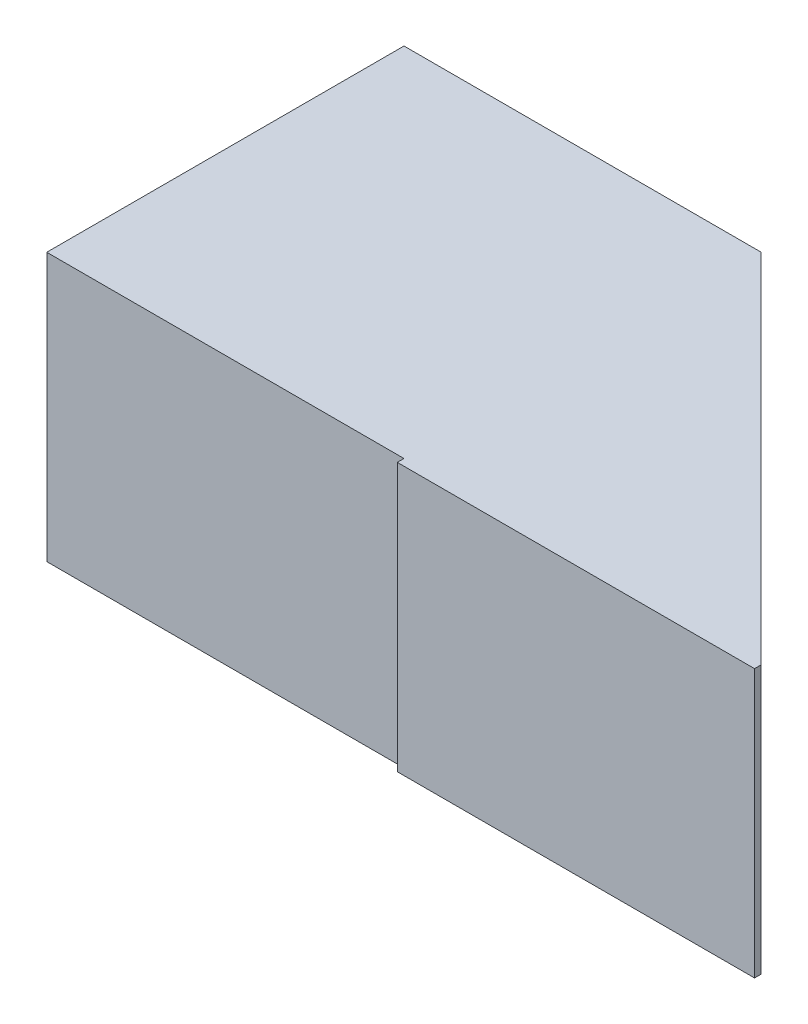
ISO-10303-21;
HEADER;
FILE_DESCRIPTION(('STEP AP214'),'2;1');
FILE_NAME('part.step','',(''),(''),'','','');
FILE_SCHEMA(('AUTOMOTIVE_DESIGN { 1 0 10303 214 1 1 1 1 }'));
ENDSEC;
DATA;
#1=APPLICATION_CONTEXT('core data for automotive mechanical design processes');
#2=APPLICATION_PROTOCOL_DEFINITION('international standard','automotive_design',2000,#1);
#3=PRODUCT_CONTEXT('',#1,'mechanical');
#4=PRODUCT('Part','Part','',(#3));
#5=PRODUCT_RELATED_PRODUCT_CATEGORY('part','',(#4));
#6=PRODUCT_DEFINITION_FORMATION('','',#4);
#7=PRODUCT_DEFINITION_CONTEXT('part definition',#1,'design');
#8=PRODUCT_DEFINITION('design','',#6,#7);
#9=PRODUCT_DEFINITION_SHAPE('','',#8);
#10=(LENGTH_UNIT() NAMED_UNIT(*) SI_UNIT(.MILLI.,.METRE.));
#11=(NAMED_UNIT(*) PLANE_ANGLE_UNIT() SI_UNIT($,.RADIAN.));
#12=(NAMED_UNIT(*) SI_UNIT($,.STERADIAN.) SOLID_ANGLE_UNIT());
#13=UNCERTAINTY_MEASURE_WITH_UNIT(LENGTH_MEASURE(1.E-05),#10,'distance_accuracy_value','');
#14=(GEOMETRIC_REPRESENTATION_CONTEXT(3) GLOBAL_UNCERTAINTY_ASSIGNED_CONTEXT((#13)) GLOBAL_UNIT_ASSIGNED_CONTEXT((#10,
#11,#12)) REPRESENTATION_CONTEXT('',''));
#15=CARTESIAN_POINT('',(0.,0.,0.));
#16=DIRECTION('',(0.,0.,1.));
#17=DIRECTION('',(1.,0.,0.));
#18=AXIS2_PLACEMENT_3D('',#15,#16,#17);
#19=CARTESIAN_POINT('',(0.,6.,0.));
#20=DIRECTION('',(0.,0.,-1.));
#21=DIRECTION('',(-1.,0.,0.));
#22=AXIS2_PLACEMENT_3D('',#19,#20,#21);
#23=PLANE('',#22);
#24=DIRECTION('',(0.,-1.,0.));
#25=VECTOR('',#24,1.);
#26=CARTESIAN_POINT('',(8.,6.,0.));
#27=LINE('',#26,#25);
#28=CARTESIAN_POINT('',(8.,6.,0.));
#29=VERTEX_POINT('',#28);
#30=CARTESIAN_POINT('',(8.,0.,0.));
#31=VERTEX_POINT('',#30);
#32=EDGE_CURVE('E49',#29,#31,#27,.T.);
#33=ORIENTED_EDGE('',*,*,#32,.F.);
#34=DIRECTION('',(1.,0.,0.));
#35=VECTOR('',#34,1.);
#36=CARTESIAN_POINT('',(0.,6.,0.));
#37=LINE('',#36,#35);
#38=CARTESIAN_POINT('',(0.,6.,0.));
#39=VERTEX_POINT('',#38);
#40=EDGE_CURVE('E82',#39,#29,#37,.T.);
#41=ORIENTED_EDGE('',*,*,#40,.F.);
#42=DIRECTION('',(0.,-1.,0.));
#43=VECTOR('',#42,1.);
#44=CARTESIAN_POINT('',(0.,6.,0.));
#45=LINE('',#44,#43);
#46=CARTESIAN_POINT('',(0.,0.,0.));
#47=VERTEX_POINT('',#46);
#48=EDGE_CURVE('E11',#39,#47,#45,.T.);
#49=ORIENTED_EDGE('',*,*,#48,.T.);
#50=DIRECTION('',(1.,0.,0.));
#51=VECTOR('',#50,1.);
#52=CARTESIAN_POINT('',(0.,0.,0.));
#53=LINE('',#52,#51);
#54=EDGE_CURVE('E124',#47,#31,#53,.T.);
#55=ORIENTED_EDGE('',*,*,#54,.T.);
#56=EDGE_LOOP('',(#33,#41,#49,#55));
#57=FACE_BOUND('',#56,.T.);
#58=ADVANCED_FACE('F34',(#57),#23,.F.);
#59=CARTESIAN_POINT('',(0.,6.,-8.));
#60=DIRECTION('',(1.,0.,0.));
#61=DIRECTION('',(0.,0.,-1.));
#62=AXIS2_PLACEMENT_3D('',#59,#60,#61);
#63=PLANE('',#62);
#64=DIRECTION('',(0.,0.,1.));
#65=VECTOR('',#64,1.);
#66=CARTESIAN_POINT('',(0.,0.,-8.));
#67=LINE('',#66,#65);
#68=CARTESIAN_POINT('',(0.,0.,-8.));
#69=VERTEX_POINT('',#68);
#70=EDGE_CURVE('E121',#69,#47,#67,.T.);
#71=ORIENTED_EDGE('',*,*,#70,.T.);
#72=ORIENTED_EDGE('',*,*,#48,.F.);
#73=DIRECTION('',(0.,0.,1.));
#74=VECTOR('',#73,1.);
#75=CARTESIAN_POINT('',(0.,6.,-8.));
#76=LINE('',#75,#74);
#77=CARTESIAN_POINT('',(0.,6.,-8.));
#78=VERTEX_POINT('',#77);
#79=EDGE_CURVE('E130',#78,#39,#76,.T.);
#80=ORIENTED_EDGE('',*,*,#79,.F.);
#81=DIRECTION('',(0.,-1.,0.));
#82=VECTOR('',#81,1.);
#83=CARTESIAN_POINT('',(0.,6.,-8.));
#84=LINE('',#83,#82);
#85=EDGE_CURVE('E135',#78,#69,#84,.T.);
#86=ORIENTED_EDGE('',*,*,#85,.T.);
#87=EDGE_LOOP('',(#71,#72,#80,#86));
#88=FACE_BOUND('',#87,.T.);
#89=ADVANCED_FACE('F36',(#88),#63,.F.);
#90=CARTESIAN_POINT('',(16.,6.,0.));
#91=DIRECTION('',(-0.707106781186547,0.,0.707106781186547));
#92=DIRECTION('',(0.707106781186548,0.,0.707106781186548));
#93=AXIS2_PLACEMENT_3D('',#90,#91,#92);
#94=PLANE('',#93);
#95=DIRECTION('',(-0.707106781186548,0.,-0.707106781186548));
#96=VECTOR('',#95,1.);
#97=CARTESIAN_POINT('',(16.,0.,0.));
#98=LINE('',#97,#96);
#99=CARTESIAN_POINT('',(16.,0.,0.));
#100=VERTEX_POINT('',#99);
#101=CARTESIAN_POINT('',(8.,0.,-8.));
#102=VERTEX_POINT('',#101);
#103=EDGE_CURVE('E138',#100,#102,#98,.T.);
#104=ORIENTED_EDGE('',*,*,#103,.T.);
#105=DIRECTION('',(0.,-1.,0.));
#106=VECTOR('',#105,1.);
#107=CARTESIAN_POINT('',(8.,6.,-8.));
#108=LINE('',#107,#106);
#109=CARTESIAN_POINT('',(8.,6.,-8.));
#110=VERTEX_POINT('',#109);
#111=EDGE_CURVE('E142',#110,#102,#108,.T.);
#112=ORIENTED_EDGE('',*,*,#111,.F.);
#113=DIRECTION('',(-0.707106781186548,0.,-0.707106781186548));
#114=VECTOR('',#113,1.);
#115=CARTESIAN_POINT('',(16.,6.,0.));
#116=LINE('',#115,#114);
#117=CARTESIAN_POINT('',(16.,6.,0.));
#118=VERTEX_POINT('',#117);
#119=EDGE_CURVE('E133',#118,#110,#116,.T.);
#120=ORIENTED_EDGE('',*,*,#119,.F.);
#121=DIRECTION('',(0.,-1.,0.));
#122=VECTOR('',#121,1.);
#123=CARTESIAN_POINT('',(16.,6.,0.));
#124=LINE('',#123,#122);
#125=EDGE_CURVE('E42',#118,#100,#124,.T.);
#126=ORIENTED_EDGE('',*,*,#125,.T.);
#127=EDGE_LOOP('',(#104,#112,#120,#126));
#128=FACE_BOUND('',#127,.T.);
#129=ADVANCED_FACE('F145',(#128),#94,.F.);
#130=CARTESIAN_POINT('',(8.,6.,-8.));
#131=DIRECTION('',(0.,0.,1.));
#132=DIRECTION('',(1.,0.,0.));
#133=AXIS2_PLACEMENT_3D('',#130,#131,#132);
#134=PLANE('',#133);
#135=DIRECTION('',(-1.,0.,0.));
#136=VECTOR('',#135,1.);
#137=CARTESIAN_POINT('',(8.,0.,-8.));
#138=LINE('',#137,#136);
#139=EDGE_CURVE('E79',#102,#69,#138,.T.);
#140=ORIENTED_EDGE('',*,*,#139,.T.);
#141=ORIENTED_EDGE('',*,*,#85,.F.);
#142=DIRECTION('',(-1.,0.,0.));
#143=VECTOR('',#142,1.);
#144=CARTESIAN_POINT('',(8.,6.,-8.));
#145=LINE('',#144,#143);
#146=EDGE_CURVE('E58',#110,#78,#145,.T.);
#147=ORIENTED_EDGE('',*,*,#146,.F.);
#148=ORIENTED_EDGE('',*,*,#111,.T.);
#149=EDGE_LOOP('',(#140,#141,#147,#148));
#150=FACE_BOUND('',#149,.T.);
#151=ADVANCED_FACE('F162',(#150),#134,.F.);
#152=CARTESIAN_POINT('',(0.,6.,0.));
#153=DIRECTION('',(0.,1.,0.));
#154=DIRECTION('',(0.,0.,1.));
#155=AXIS2_PLACEMENT_3D('',#152,#153,#154);
#156=PLANE('',#155);
#157=ORIENTED_EDGE('',*,*,#79,.T.);
#158=ORIENTED_EDGE('',*,*,#40,.T.);
#159=DIRECTION('',(0.,0.,-1.));
#160=VECTOR('',#159,1.);
#161=CARTESIAN_POINT('',(8.,6.,0.15));
#162=LINE('',#161,#160);
#163=CARTESIAN_POINT('',(8.,6.,0.15));
#164=VERTEX_POINT('',#163);
#165=EDGE_CURVE('E106',#164,#29,#162,.T.);
#166=ORIENTED_EDGE('',*,*,#165,.F.);
#167=DIRECTION('',(-1.,0.,0.));
#168=VECTOR('',#167,1.);
#169=CARTESIAN_POINT('',(16.,6.,0.15));
#170=LINE('',#169,#168);
#171=CARTESIAN_POINT('',(16.,6.,0.15));
#172=VERTEX_POINT('',#171);
#173=EDGE_CURVE('E99',#172,#164,#170,.T.);
#174=ORIENTED_EDGE('',*,*,#173,.F.);
#175=DIRECTION('',(0.,0.,-1.));
#176=VECTOR('',#175,1.);
#177=CARTESIAN_POINT('',(16.,6.,0.15));
#178=LINE('',#177,#176);
#179=EDGE_CURVE('E103',#172,#118,#178,.T.);
#180=ORIENTED_EDGE('',*,*,#179,.T.);
#181=ORIENTED_EDGE('',*,*,#119,.T.);
#182=ORIENTED_EDGE('',*,*,#146,.T.);
#183=EDGE_LOOP('',(#157,#158,#166,#174,#180,#181,#182));
#184=FACE_BOUND('',#183,.T.);
#185=ADVANCED_FACE('F101',(#184),#156,.T.);
#186=CARTESIAN_POINT('',(0.,0.,0.));
#187=DIRECTION('',(0.,1.,0.));
#188=DIRECTION('',(0.,0.,1.));
#189=AXIS2_PLACEMENT_3D('',#186,#187,#188);
#190=PLANE('',#189);
#191=ORIENTED_EDGE('',*,*,#70,.F.);
#192=ORIENTED_EDGE('',*,*,#139,.F.);
#193=ORIENTED_EDGE('',*,*,#103,.F.);
#194=DIRECTION('',(0.,0.,-1.));
#195=VECTOR('',#194,1.);
#196=CARTESIAN_POINT('',(16.,0.,0.15));
#197=LINE('',#196,#195);
#198=CARTESIAN_POINT('',(16.,0.,0.15));
#199=VERTEX_POINT('',#198);
#200=EDGE_CURVE('E150',#199,#100,#197,.T.);
#201=ORIENTED_EDGE('',*,*,#200,.F.);
#202=DIRECTION('',(1.,0.,0.));
#203=VECTOR('',#202,1.);
#204=CARTESIAN_POINT('',(16.,0.,0.15));
#205=LINE('',#204,#203);
#206=CARTESIAN_POINT('',(8.,0.,0.15));
#207=VERTEX_POINT('',#206);
#208=EDGE_CURVE('E115',#207,#199,#205,.T.);
#209=ORIENTED_EDGE('',*,*,#208,.F.);
#210=DIRECTION('',(0.,0.,-1.));
#211=VECTOR('',#210,1.);
#212=CARTESIAN_POINT('',(8.,0.,0.15));
#213=LINE('',#212,#211);
#214=EDGE_CURVE('E126',#207,#31,#213,.T.);
#215=ORIENTED_EDGE('',*,*,#214,.T.);
#216=ORIENTED_EDGE('',*,*,#54,.F.);
#217=EDGE_LOOP('',(#191,#192,#193,#201,#209,#215,#216));
#218=FACE_BOUND('',#217,.T.);
#219=ADVANCED_FACE('F149',(#218),#190,.F.);
#220=CARTESIAN_POINT('',(16.,6.,0.15));
#221=DIRECTION('',(-1.,0.,0.));
#222=DIRECTION('',(0.,0.,1.));
#223=AXIS2_PLACEMENT_3D('',#220,#221,#222);
#224=PLANE('',#223);
#225=ORIENTED_EDGE('',*,*,#125,.F.);
#226=ORIENTED_EDGE('',*,*,#179,.F.);
#227=DIRECTION('',(0.,1.,0.));
#228=VECTOR('',#227,1.);
#229=CARTESIAN_POINT('',(16.,6.,0.15));
#230=LINE('',#229,#228);
#231=EDGE_CURVE('E110',#199,#172,#230,.T.);
#232=ORIENTED_EDGE('',*,*,#231,.F.);
#233=ORIENTED_EDGE('',*,*,#200,.T.);
#234=EDGE_LOOP('',(#225,#226,#232,#233));
#235=FACE_BOUND('',#234,.T.);
#236=ADVANCED_FACE('F120',(#235),#224,.F.);
#237=CARTESIAN_POINT('',(8.,6.,0.15));
#238=DIRECTION('',(1.,0.,0.));
#239=DIRECTION('',(0.,0.,-1.));
#240=AXIS2_PLACEMENT_3D('',#237,#238,#239);
#241=PLANE('',#240);
#242=ORIENTED_EDGE('',*,*,#32,.T.);
#243=ORIENTED_EDGE('',*,*,#214,.F.);
#244=DIRECTION('',(0.,-1.,0.));
#245=VECTOR('',#244,1.);
#246=CARTESIAN_POINT('',(8.,6.,0.15));
#247=LINE('',#246,#245);
#248=EDGE_CURVE('E109',#164,#207,#247,.T.);
#249=ORIENTED_EDGE('',*,*,#248,.F.);
#250=ORIENTED_EDGE('',*,*,#165,.T.);
#251=EDGE_LOOP('',(#242,#243,#249,#250));
#252=FACE_BOUND('',#251,.T.);
#253=ADVANCED_FACE('F158',(#252),#241,.F.);
#254=CARTESIAN_POINT('',(0.,0.,0.15));
#255=DIRECTION('',(0.,0.,-1.));
#256=DIRECTION('',(-1.,0.,0.));
#257=AXIS2_PLACEMENT_3D('',#254,#255,#256);
#258=PLANE('',#257);
#259=ORIENTED_EDGE('',*,*,#231,.T.);
#260=ORIENTED_EDGE('',*,*,#173,.T.);
#261=ORIENTED_EDGE('',*,*,#248,.T.);
#262=ORIENTED_EDGE('',*,*,#208,.T.);
#263=EDGE_LOOP('',(#259,#260,#261,#262));
#264=FACE_BOUND('',#263,.T.);
#265=ADVANCED_FACE('F113',(#264),#258,.F.);
#266=CLOSED_SHELL('',(#58,#89,#129,#151,#185,#219,#236,#253,#265));
#267=MANIFOLD_SOLID_BREP('B2',#266);
#268=ADVANCED_BREP_SHAPE_REPRESENTATION('',(#18,#267),#14);
#269=SHAPE_DEFINITION_REPRESENTATION(#9,#268);
ENDSEC;
END-ISO-10303-21;
